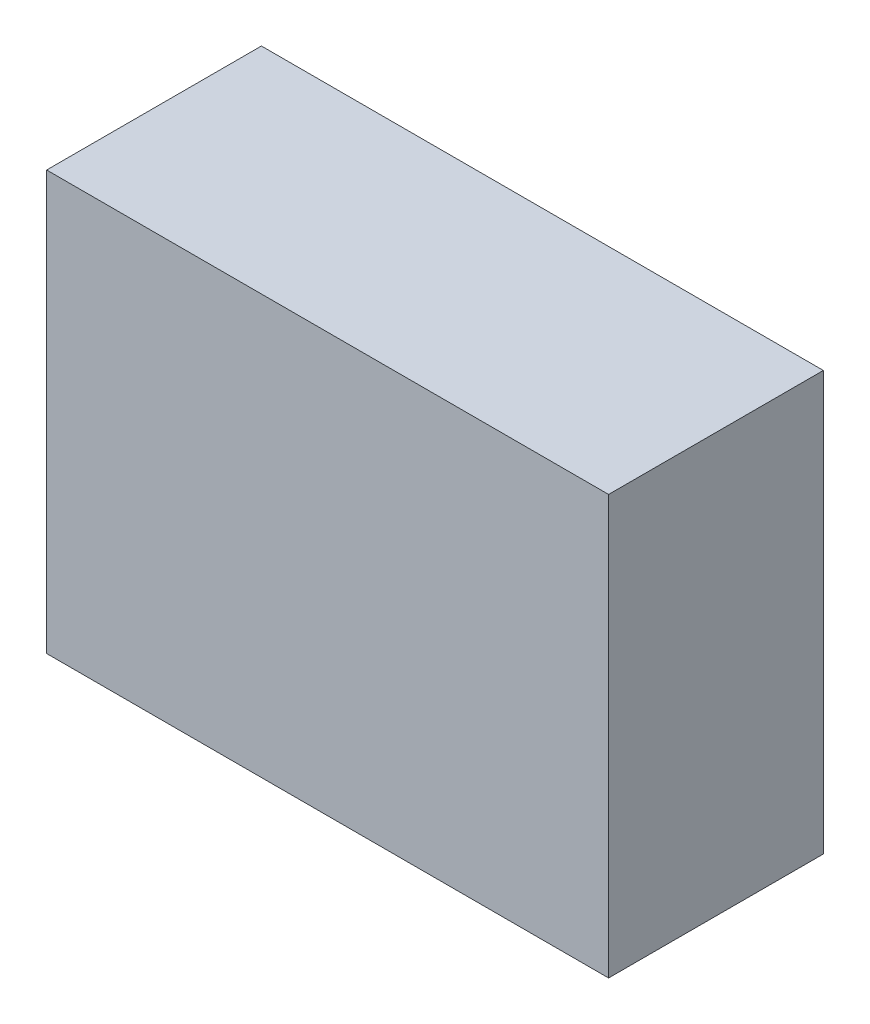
ISO-10303-21;
HEADER;
FILE_DESCRIPTION(('STEP AP214'),'2;1');
FILE_NAME('part.step','',(''),(''),'','','');
FILE_SCHEMA(('AUTOMOTIVE_DESIGN { 1 0 10303 214 1 1 1 1 }'));
ENDSEC;
DATA;
#1=APPLICATION_CONTEXT('core data for automotive mechanical design processes');
#2=APPLICATION_PROTOCOL_DEFINITION('international standard','automotive_design',2000,#1);
#3=PRODUCT_CONTEXT('',#1,'mechanical');
#4=PRODUCT('Part','Part','',(#3));
#5=PRODUCT_RELATED_PRODUCT_CATEGORY('part','',(#4));
#6=PRODUCT_DEFINITION_FORMATION('','',#4);
#7=PRODUCT_DEFINITION_CONTEXT('part definition',#1,'design');
#8=PRODUCT_DEFINITION('design','',#6,#7);
#9=PRODUCT_DEFINITION_SHAPE('','',#8);
#10=(LENGTH_UNIT() NAMED_UNIT(*) SI_UNIT(.MILLI.,.METRE.));
#11=(NAMED_UNIT(*) PLANE_ANGLE_UNIT() SI_UNIT($,.RADIAN.));
#12=(NAMED_UNIT(*) SI_UNIT($,.STERADIAN.) SOLID_ANGLE_UNIT());
#13=UNCERTAINTY_MEASURE_WITH_UNIT(LENGTH_MEASURE(1.E-05),#10,'distance_accuracy_value','');
#14=(GEOMETRIC_REPRESENTATION_CONTEXT(3) GLOBAL_UNCERTAINTY_ASSIGNED_CONTEXT((#13)) GLOBAL_UNIT_ASSIGNED_CONTEXT((#10,
#11,#12)) REPRESENTATION_CONTEXT('',''));
#15=CARTESIAN_POINT('',(0.,0.,0.));
#16=DIRECTION('',(0.,0.,1.));
#17=DIRECTION('',(1.,0.,0.));
#18=AXIS2_PLACEMENT_3D('',#15,#16,#17);
#19=CARTESIAN_POINT('',(-0.78499975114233,0.585000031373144,0.));
#20=DIRECTION('',(-8.74227765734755E-08,0.999999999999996,0.));
#21=DIRECTION('',(0.999999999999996,8.74227765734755E-08,0.));
#22=AXIS2_PLACEMENT_3D('',#19,#20,#21);
#23=PLANE('',#22);
#24=DIRECTION('',(0.,0.,1.));
#25=VECTOR('',#24,1.);
#26=CARTESIAN_POINT('',(-0.78499975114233,0.585000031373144,0.));
#27=LINE('',#26,#25);
#28=CARTESIAN_POINT('',(-0.78499975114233,0.585000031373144,0.));
#29=VERTEX_POINT('',#28);
#30=CARTESIAN_POINT('',(-0.78499975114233,0.585000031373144,0.5999988));
#31=VERTEX_POINT('',#30);
#32=EDGE_CURVE('E11',#29,#31,#27,.T.);
#33=ORIENTED_EDGE('',*,*,#32,.T.);
#34=DIRECTION('',(0.999999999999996,8.74227765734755E-08,0.));
#35=VECTOR('',#34,1.);
#36=CARTESIAN_POINT('',(-0.78499975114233,0.585000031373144,0.5999988));
#37=LINE('',#36,#35);
#38=CARTESIAN_POINT('',(0.784999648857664,0.585000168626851,0.5999988));
#39=VERTEX_POINT('',#38);
#40=EDGE_CURVE('E24',#31,#39,#37,.T.);
#41=ORIENTED_EDGE('',*,*,#40,.T.);
#42=DIRECTION('',(0.,0.,1.));
#43=VECTOR('',#42,1.);
#44=CARTESIAN_POINT('',(0.784999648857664,0.585000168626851,0.));
#45=LINE('',#44,#43);
#46=CARTESIAN_POINT('',(0.784999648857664,0.585000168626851,0.));
#47=VERTEX_POINT('',#46);
#48=EDGE_CURVE('E84',#47,#39,#45,.T.);
#49=ORIENTED_EDGE('',*,*,#48,.F.);
#50=DIRECTION('',(0.999999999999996,8.74227765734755E-08,0.));
#51=VECTOR('',#50,1.);
#52=CARTESIAN_POINT('',(-0.78499975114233,0.585000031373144,0.));
#53=LINE('',#52,#51);
#54=EDGE_CURVE('E82',#29,#47,#53,.T.);
#55=ORIENTED_EDGE('',*,*,#54,.F.);
#56=EDGE_LOOP('',(#33,#41,#49,#55));
#57=FACE_BOUND('',#56,.T.);
#58=ADVANCED_FACE('F17',(#57),#23,.T.);
#59=CARTESIAN_POINT('',(0.784999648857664,0.585000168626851,0.));
#60=DIRECTION('',(0.999999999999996,8.74227765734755E-08,0.));
#61=DIRECTION('',(8.74227765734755E-08,-0.999999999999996,0.));
#62=AXIS2_PLACEMENT_3D('',#59,#60,#61);
#63=PLANE('',#62);
#64=ORIENTED_EDGE('',*,*,#48,.T.);
#65=DIRECTION('',(8.74227765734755E-08,-0.999999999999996,0.));
#66=VECTOR('',#65,1.);
#67=CARTESIAN_POINT('',(0.784999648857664,0.585000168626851,0.5999988));
#68=LINE('',#67,#66);
#69=CARTESIAN_POINT('',(0.78499975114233,-0.585000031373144,0.5999988));
#70=VERTEX_POINT('',#69);
#71=EDGE_CURVE('E79',#39,#70,#68,.T.);
#72=ORIENTED_EDGE('',*,*,#71,.T.);
#73=DIRECTION('',(0.,0.,1.));
#74=VECTOR('',#73,1.);
#75=CARTESIAN_POINT('',(0.78499975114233,-0.585000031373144,0.));
#76=LINE('',#75,#74);
#77=CARTESIAN_POINT('',(0.78499975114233,-0.585000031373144,0.));
#78=VERTEX_POINT('',#77);
#79=EDGE_CURVE('E77',#78,#70,#76,.T.);
#80=ORIENTED_EDGE('',*,*,#79,.F.);
#81=DIRECTION('',(8.74227765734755E-08,-0.999999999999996,0.));
#82=VECTOR('',#81,1.);
#83=CARTESIAN_POINT('',(0.784999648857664,0.585000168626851,0.));
#84=LINE('',#83,#82);
#85=EDGE_CURVE('E67',#47,#78,#84,.T.);
#86=ORIENTED_EDGE('',*,*,#85,.F.);
#87=EDGE_LOOP('',(#64,#72,#80,#86));
#88=FACE_BOUND('',#87,.T.);
#89=ADVANCED_FACE('F90',(#88),#63,.T.);
#90=CARTESIAN_POINT('',(0.78499975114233,-0.585000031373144,0.));
#91=DIRECTION('',(8.74227765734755E-08,-0.999999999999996,0.));
#92=DIRECTION('',(-0.999999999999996,-8.74227765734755E-08,0.));
#93=AXIS2_PLACEMENT_3D('',#90,#91,#92);
#94=PLANE('',#93);
#95=ORIENTED_EDGE('',*,*,#79,.T.);
#96=DIRECTION('',(-0.999999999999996,-8.74227765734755E-08,0.));
#97=VECTOR('',#96,1.);
#98=CARTESIAN_POINT('',(0.78499975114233,-0.585000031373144,0.5999988));
#99=LINE('',#98,#97);
#100=CARTESIAN_POINT('',(-0.784999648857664,-0.585000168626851,0.5999988));
#101=VERTEX_POINT('',#100);
#102=EDGE_CURVE('E59',#70,#101,#99,.T.);
#103=ORIENTED_EDGE('',*,*,#102,.T.);
#104=DIRECTION('',(0.,0.,1.));
#105=VECTOR('',#104,1.);
#106=CARTESIAN_POINT('',(-0.784999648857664,-0.585000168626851,0.));
#107=LINE('',#106,#105);
#108=CARTESIAN_POINT('',(-0.784999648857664,-0.585000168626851,0.));
#109=VERTEX_POINT('',#108);
#110=EDGE_CURVE('E54',#109,#101,#107,.T.);
#111=ORIENTED_EDGE('',*,*,#110,.F.);
#112=DIRECTION('',(-0.999999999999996,-8.74227765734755E-08,0.));
#113=VECTOR('',#112,1.);
#114=CARTESIAN_POINT('',(0.78499975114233,-0.585000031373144,0.));
#115=LINE('',#114,#113);
#116=EDGE_CURVE('E58',#78,#109,#115,.T.);
#117=ORIENTED_EDGE('',*,*,#116,.F.);
#118=EDGE_LOOP('',(#95,#103,#111,#117));
#119=FACE_BOUND('',#118,.T.);
#120=ADVANCED_FACE('F57',(#119),#94,.T.);
#121=CARTESIAN_POINT('',(-0.784999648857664,-0.585000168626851,0.));
#122=DIRECTION('',(-0.999999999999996,-8.74227765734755E-08,0.));
#123=DIRECTION('',(-8.74227765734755E-08,0.999999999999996,0.));
#124=AXIS2_PLACEMENT_3D('',#121,#122,#123);
#125=PLANE('',#124);
#126=ORIENTED_EDGE('',*,*,#110,.T.);
#127=DIRECTION('',(-8.74227765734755E-08,0.999999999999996,0.));
#128=VECTOR('',#127,1.);
#129=CARTESIAN_POINT('',(-0.784999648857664,-0.585000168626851,0.5999988));
#130=LINE('',#129,#128);
#131=EDGE_CURVE('E69',#101,#31,#130,.T.);
#132=ORIENTED_EDGE('',*,*,#131,.T.);
#133=ORIENTED_EDGE('',*,*,#32,.F.);
#134=DIRECTION('',(-8.74227765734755E-08,0.999999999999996,0.));
#135=VECTOR('',#134,1.);
#136=CARTESIAN_POINT('',(-0.784999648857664,-0.585000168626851,0.));
#137=LINE('',#136,#135);
#138=EDGE_CURVE('E66',#109,#29,#137,.T.);
#139=ORIENTED_EDGE('',*,*,#138,.F.);
#140=EDGE_LOOP('',(#126,#132,#133,#139));
#141=FACE_BOUND('',#140,.T.);
#142=ADVANCED_FACE('F71',(#141),#125,.T.);
#143=CARTESIAN_POINT('',(-0.78499975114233,0.585000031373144,0.));
#144=DIRECTION('',(0.,0.,1.));
#145=DIRECTION('',(-0.999999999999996,-8.74227765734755E-08,0.));
#146=AXIS2_PLACEMENT_3D('',#143,#144,#145);
#147=PLANE('',#146);
#148=ORIENTED_EDGE('',*,*,#54,.T.);
#149=ORIENTED_EDGE('',*,*,#85,.T.);
#150=ORIENTED_EDGE('',*,*,#116,.T.);
#151=ORIENTED_EDGE('',*,*,#138,.T.);
#152=EDGE_LOOP('',(#148,#149,#150,#151));
#153=FACE_BOUND('',#152,.T.);
#154=ADVANCED_FACE('F65',(#153),#147,.F.);
#155=CARTESIAN_POINT('',(-0.78499975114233,0.585000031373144,0.5999988));
#156=DIRECTION('',(0.,0.,1.));
#157=DIRECTION('',(-0.999999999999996,-8.74227765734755E-08,0.));
#158=AXIS2_PLACEMENT_3D('',#155,#156,#157);
#159=PLANE('',#158);
#160=ORIENTED_EDGE('',*,*,#131,.F.);
#161=ORIENTED_EDGE('',*,*,#102,.F.);
#162=ORIENTED_EDGE('',*,*,#71,.F.);
#163=ORIENTED_EDGE('',*,*,#40,.F.);
#164=EDGE_LOOP('',(#160,#161,#162,#163));
#165=FACE_BOUND('',#164,.T.);
#166=ADVANCED_FACE('F91',(#165),#159,.T.);
#167=CLOSED_SHELL('',(#58,#89,#120,#142,#154,#166));
#168=MANIFOLD_SOLID_BREP('B1',#167);
#169=ADVANCED_BREP_SHAPE_REPRESENTATION('',(#18,#168),#14);
#170=SHAPE_DEFINITION_REPRESENTATION(#9,#169);
ENDSEC;
END-ISO-10303-21;
